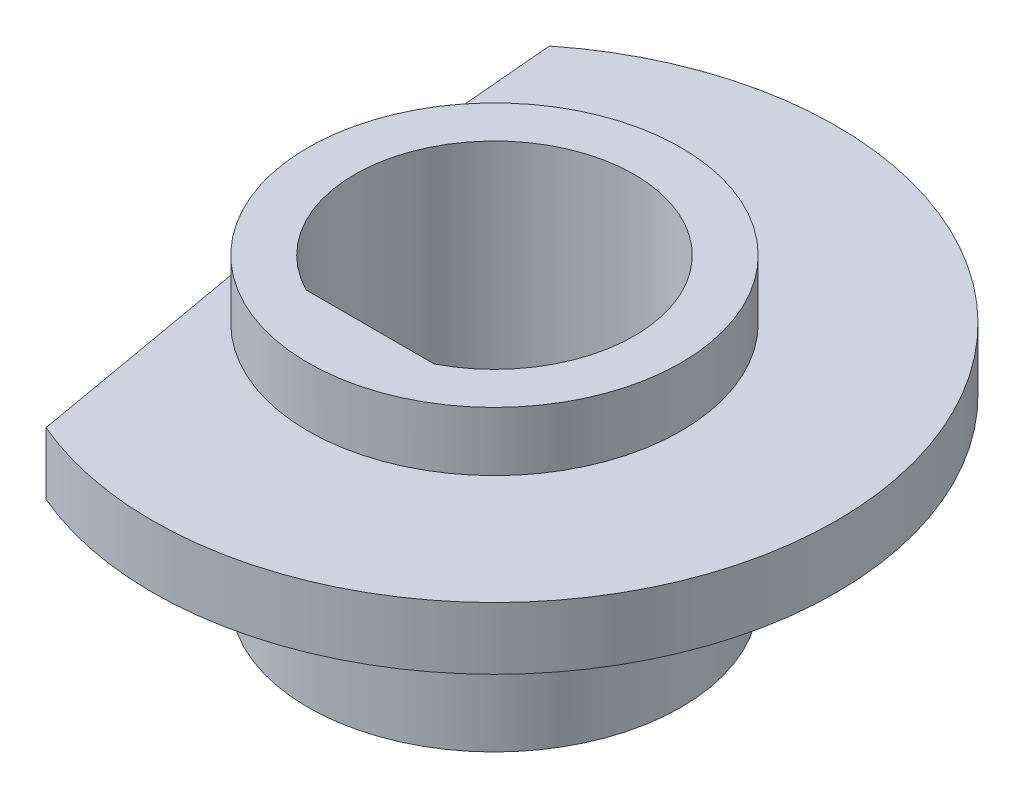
ISO-10303-21;
HEADER;
FILE_DESCRIPTION(('STEP AP214'),'2;1');
FILE_NAME('part.step','',(''),(''),'','','');
FILE_SCHEMA(('AUTOMOTIVE_DESIGN { 1 0 10303 214 1 1 1 1 }'));
ENDSEC;
DATA;
#1=APPLICATION_CONTEXT('core data for automotive mechanical design processes');
#2=APPLICATION_PROTOCOL_DEFINITION('international standard','automotive_design',2000,#1);
#3=PRODUCT_CONTEXT('',#1,'mechanical');
#4=PRODUCT('Part','Part','',(#3));
#5=PRODUCT_RELATED_PRODUCT_CATEGORY('part','',(#4));
#6=PRODUCT_DEFINITION_FORMATION('','',#4);
#7=PRODUCT_DEFINITION_CONTEXT('part definition',#1,'design');
#8=PRODUCT_DEFINITION('design','',#6,#7);
#9=PRODUCT_DEFINITION_SHAPE('','',#8);
#10=(LENGTH_UNIT() NAMED_UNIT(*) SI_UNIT(.MILLI.,.METRE.));
#11=(NAMED_UNIT(*) PLANE_ANGLE_UNIT() SI_UNIT($,.RADIAN.));
#12=(NAMED_UNIT(*) SI_UNIT($,.STERADIAN.) SOLID_ANGLE_UNIT());
#13=UNCERTAINTY_MEASURE_WITH_UNIT(LENGTH_MEASURE(1.E-05),#10,'distance_accuracy_value','');
#14=(GEOMETRIC_REPRESENTATION_CONTEXT(3) GLOBAL_UNCERTAINTY_ASSIGNED_CONTEXT((#13)) GLOBAL_UNIT_ASSIGNED_CONTEXT((#10,
#11,#12)) REPRESENTATION_CONTEXT('',''));
#15=CARTESIAN_POINT('',(0.,0.,0.));
#16=DIRECTION('',(0.,0.,1.));
#17=DIRECTION('',(1.,0.,0.));
#18=AXIS2_PLACEMENT_3D('',#15,#16,#17);
#19=CARTESIAN_POINT('',(-6.84584853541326,-9.28929420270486,-8.61013111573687));
#20=DIRECTION('',(0.996194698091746,0.,-0.087155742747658));
#21=DIRECTION('',(-0.087155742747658,0.,-0.996194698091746));
#22=AXIS2_PLACEMENT_3D('',#19,#20,#21);
#23=PLANE('',#22);
#24=DIRECTION('',(0.,-1.,0.));
#25=VECTOR('',#24,1.);
#26=CARTESIAN_POINT('',(-6.84584853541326,-8.28929420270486,-8.61013111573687));
#27=LINE('',#26,#25);
#28=CARTESIAN_POINT('',(-6.84584853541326,-9.28929420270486,-8.61013111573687));
#29=VERTEX_POINT('',#28);
#30=CARTESIAN_POINT('',(-6.84584853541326,-7.28929420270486,-8.61013111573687));
#31=VERTEX_POINT('',#30);
#32=EDGE_CURVE('E126',#29,#31,#27,.F.);
#33=ORIENTED_EDGE('',*,*,#32,.F.);
#34=DIRECTION('',(-0.087155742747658,0.,-0.996194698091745));
#35=VECTOR('',#34,1.);
#36=CARTESIAN_POINT('',(-6.09255967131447,-9.28929420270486,0.));
#37=LINE('',#36,#35);
#38=CARTESIAN_POINT('',(-6.09255967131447,-9.28929420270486,0.));
#39=VERTEX_POINT('',#38);
#40=EDGE_CURVE('E110',#39,#29,#37,.T.);
#41=ORIENTED_EDGE('',*,*,#40,.F.);
#42=DIRECTION('',(0.,1.,0.));
#43=VECTOR('',#42,1.);
#44=CARTESIAN_POINT('',(-6.09255967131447,-9.28929420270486,0.));
#45=LINE('',#44,#43);
#46=CARTESIAN_POINT('',(-6.09255967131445,-7.28929420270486,1.6502415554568E-13));
#47=VERTEX_POINT('',#46);
#48=EDGE_CURVE('E128',#39,#47,#45,.T.);
#49=ORIENTED_EDGE('',*,*,#48,.T.);
#50=DIRECTION('',(0.087155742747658,0.,0.996194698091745));
#51=VECTOR('',#50,1.);
#52=CARTESIAN_POINT('',(-6.84584853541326,-7.28929420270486,-8.61013111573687));
#53=LINE('',#52,#51);
#54=EDGE_CURVE('E59',#31,#47,#53,.T.);
#55=ORIENTED_EDGE('',*,*,#54,.F.);
#56=EDGE_LOOP('',(#33,#41,#49,#55));
#57=FACE_BOUND('',#56,.T.);
#58=ADVANCED_FACE('F15',(#57),#23,.F.);
#59=CARTESIAN_POINT('',(0.,-8.28929420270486,0.));
#60=DIRECTION('',(0.,-1.,0.));
#61=DIRECTION('',(1.,0.,0.));
#62=AXIS2_PLACEMENT_3D('',#59,#60,#61);
#63=CYLINDRICAL_SURFACE('',#62,11.);
#64=DIRECTION('',(0.,1.,0.));
#65=VECTOR('',#64,1.);
#66=CARTESIAN_POINT('',(-4.30788942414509,-9.28929420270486,10.1213679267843));
#67=LINE('',#66,#65);
#68=CARTESIAN_POINT('',(-4.30788942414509,-7.28929420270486,10.1213679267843));
#69=VERTEX_POINT('',#68);
#70=CARTESIAN_POINT('',(-4.30788942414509,-9.28929420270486,10.1213679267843));
#71=VERTEX_POINT('',#70);
#72=EDGE_CURVE('E54',#69,#71,#67,.F.);
#73=ORIENTED_EDGE('',*,*,#72,.T.);
#74=CARTESIAN_POINT('',(0.,-9.28929420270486,0.));
#75=DIRECTION('',(0.,-1.,0.));
#76=DIRECTION('',(1.,0.,0.));
#77=AXIS2_PLACEMENT_3D('',#74,#75,#76);
#78=CIRCLE('',#77,11.);
#79=EDGE_CURVE('E109',#29,#71,#78,.T.);
#80=ORIENTED_EDGE('',*,*,#79,.F.);
#81=ORIENTED_EDGE('',*,*,#32,.T.);
#82=CARTESIAN_POINT('',(0.,-7.28929420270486,0.));
#83=DIRECTION('',(0.,-1.,0.));
#84=DIRECTION('',(1.,0.,0.));
#85=AXIS2_PLACEMENT_3D('',#82,#83,#84);
#86=CIRCLE('',#85,11.);
#87=EDGE_CURVE('E19',#69,#31,#86,.F.);
#88=ORIENTED_EDGE('',*,*,#87,.F.);
#89=EDGE_LOOP('',(#73,#80,#81,#88));
#90=FACE_BOUND('',#89,.T.);
#91=ADVANCED_FACE('F143',(#90),#63,.T.);
#92=CARTESIAN_POINT('',(-6.09255967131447,-9.28929420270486,0.));
#93=DIRECTION('',(0.984807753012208,0.,-0.17364817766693));
#94=DIRECTION('',(-0.17364817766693,0.,-0.984807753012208));
#95=AXIS2_PLACEMENT_3D('',#92,#93,#94);
#96=PLANE('',#95);
#97=ORIENTED_EDGE('',*,*,#48,.F.);
#98=DIRECTION('',(-0.17364817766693,0.,-0.984807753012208));
#99=VECTOR('',#98,1.);
#100=CARTESIAN_POINT('',(-6.09255967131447,-9.28929420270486,0.));
#101=LINE('',#100,#99);
#102=CARTESIAN_POINT('',(-5.90884651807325,-9.28929420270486,1.04188906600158));
#103=VERTEX_POINT('',#102);
#104=EDGE_CURVE('E125',#103,#39,#101,.T.);
#105=ORIENTED_EDGE('',*,*,#104,.F.);
#106=DIRECTION('',(-0.17364817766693,0.,-0.984807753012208));
#107=VECTOR('',#106,1.);
#108=CARTESIAN_POINT('',(-4.3078894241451,-9.28929420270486,10.1213679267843));
#109=LINE('',#108,#107);
#110=EDGE_CURVE('E108',#71,#103,#109,.T.);
#111=ORIENTED_EDGE('',*,*,#110,.F.);
#112=ORIENTED_EDGE('',*,*,#72,.F.);
#113=DIRECTION('',(0.17364817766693,0.,0.984807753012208));
#114=VECTOR('',#113,1.);
#115=CARTESIAN_POINT('',(-5.90884651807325,-7.28929420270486,1.04188906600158));
#116=LINE('',#115,#114);
#117=CARTESIAN_POINT('',(-5.90884651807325,-7.28929420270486,1.04188906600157));
#118=VERTEX_POINT('',#117);
#119=EDGE_CURVE('E119',#118,#69,#116,.T.);
#120=ORIENTED_EDGE('',*,*,#119,.F.);
#121=DIRECTION('',(0.173648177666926,0.,0.984807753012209));
#122=VECTOR('',#121,1.);
#123=CARTESIAN_POINT('',(-6.09255967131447,-7.28929420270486,0.));
#124=LINE('',#123,#122);
#125=EDGE_CURVE('E34',#47,#118,#124,.T.);
#126=ORIENTED_EDGE('',*,*,#125,.F.);
#127=EDGE_LOOP('',(#97,#105,#111,#112,#120,#126));
#128=FACE_BOUND('',#127,.T.);
#129=ADVANCED_FACE('F146',(#128),#96,.F.);
#130=CARTESIAN_POINT('',(8.5,-7.28929420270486,0.));
#131=DIRECTION('',(0.,1.,0.));
#132=DIRECTION('',(0.,0.,1.));
#133=AXIS2_PLACEMENT_3D('',#130,#131,#132);
#134=PLANE('',#133);
#135=ORIENTED_EDGE('',*,*,#119,.T.);
#136=ORIENTED_EDGE('',*,*,#87,.T.);
#137=ORIENTED_EDGE('',*,*,#54,.T.);
#138=ORIENTED_EDGE('',*,*,#125,.T.);
#139=CARTESIAN_POINT('',(0.,-7.28929420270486,0.));
#140=DIRECTION('',(0.,-1.,0.));
#141=DIRECTION('',(1.,0.,0.));
#142=AXIS2_PLACEMENT_3D('',#139,#140,#141);
#143=CIRCLE('',#142,6.);
#144=EDGE_CURVE('E107',#118,#118,#143,.F.);
#145=ORIENTED_EDGE('',*,*,#144,.F.);
#146=EDGE_LOOP('',(#135,#136,#137,#138,#145));
#147=FACE_BOUND('',#146,.T.);
#148=ADVANCED_FACE('F141',(#147),#134,.T.);
#149=CARTESIAN_POINT('',(8.5,-9.28929420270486,0.));
#150=DIRECTION('',(0.,-1.,0.));
#151=DIRECTION('',(0.,0.,-1.));
#152=AXIS2_PLACEMENT_3D('',#149,#150,#151);
#153=PLANE('',#152);
#154=CARTESIAN_POINT('',(0.,-9.28929420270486,0.));
#155=DIRECTION('',(0.,-1.,0.));
#156=DIRECTION('',(1.,0.,0.));
#157=AXIS2_PLACEMENT_3D('',#154,#155,#156);
#158=CIRCLE('',#157,6.);
#159=EDGE_CURVE('E104',#103,#103,#158,.T.);
#160=ORIENTED_EDGE('',*,*,#159,.F.);
#161=ORIENTED_EDGE('',*,*,#104,.T.);
#162=ORIENTED_EDGE('',*,*,#40,.T.);
#163=ORIENTED_EDGE('',*,*,#79,.T.);
#164=ORIENTED_EDGE('',*,*,#110,.T.);
#165=EDGE_LOOP('',(#160,#161,#162,#163,#164));
#166=FACE_BOUND('',#165,.T.);
#167=ADVANCED_FACE('F145',(#166),#153,.T.);
#168=CARTESIAN_POINT('',(0.,-6.33929420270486,0.));
#169=DIRECTION('',(0.,-1.,0.));
#170=DIRECTION('',(1.,0.,0.));
#171=AXIS2_PLACEMENT_3D('',#168,#169,#170);
#172=CYLINDRICAL_SURFACE('',#171,6.);
#173=CARTESIAN_POINT('',(0.,-5.38929420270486,0.));
#174=DIRECTION('',(0.,-1.,0.));
#175=DIRECTION('',(1.,0.,0.));
#176=AXIS2_PLACEMENT_3D('',#173,#174,#175);
#177=CIRCLE('',#176,6.);
#178=CARTESIAN_POINT('',(6.,-5.38929420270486,0.));
#179=VERTEX_POINT('',#178);
#180=EDGE_CURVE('E101',#179,#179,#177,.F.);
#181=ORIENTED_EDGE('',*,*,#180,.F.);
#182=EDGE_LOOP('',(#181));
#183=FACE_BOUND('',#182,.T.);
#184=ORIENTED_EDGE('',*,*,#144,.T.);
#185=EDGE_LOOP('',(#184));
#186=FACE_BOUND('',#185,.T.);
#187=ADVANCED_FACE('F151',(#183,#186),#172,.T.);
#188=CARTESIAN_POINT('',(0.,-12.1392942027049,0.));
#189=DIRECTION('',(0.,-1.,0.));
#190=DIRECTION('',(1.,0.,0.));
#191=AXIS2_PLACEMENT_3D('',#188,#189,#190);
#192=CYLINDRICAL_SURFACE('',#191,6.);
#193=ORIENTED_EDGE('',*,*,#159,.T.);
#194=EDGE_LOOP('',(#193));
#195=FACE_BOUND('',#194,.T.);
#196=CARTESIAN_POINT('',(0.,-14.9892942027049,0.));
#197=DIRECTION('',(0.,-1.,0.));
#198=DIRECTION('',(1.,0.,0.));
#199=AXIS2_PLACEMENT_3D('',#196,#197,#198);
#200=CIRCLE('',#199,6.);
#201=CARTESIAN_POINT('',(6.,-14.9892942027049,0.));
#202=VERTEX_POINT('',#201);
#203=EDGE_CURVE('E85',#202,#202,#200,.T.);
#204=ORIENTED_EDGE('',*,*,#203,.F.);
#205=EDGE_LOOP('',(#204));
#206=FACE_BOUND('',#205,.T.);
#207=ADVANCED_FACE('F148',(#195,#206),#192,.T.);
#208=CARTESIAN_POINT('',(5.25,-5.38929420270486,0.));
#209=DIRECTION('',(0.,1.,0.));
#210=DIRECTION('',(0.,0.,1.));
#211=AXIS2_PLACEMENT_3D('',#208,#209,#210);
#212=PLANE('',#211);
#213=CARTESIAN_POINT('',(0.,-5.38929420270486,0.));
#214=DIRECTION('',(0.,-1.,0.));
#215=DIRECTION('',(1.,0.,0.));
#216=AXIS2_PLACEMENT_3D('',#213,#214,#215);
#217=CIRCLE('',#216,4.5);
#218=CARTESIAN_POINT('',(-2.06155281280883,-5.38929420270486,4.));
#219=VERTEX_POINT('',#218);
#220=CARTESIAN_POINT('',(2.06155281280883,-5.38929420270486,4.));
#221=VERTEX_POINT('',#220);
#222=EDGE_CURVE('E89',#219,#221,#217,.T.);
#223=ORIENTED_EDGE('',*,*,#222,.T.);
#224=DIRECTION('',(-1.,0.,0.));
#225=VECTOR('',#224,1.);
#226=CARTESIAN_POINT('',(-2.06155281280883,-5.38929420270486,4.));
#227=LINE('',#226,#225);
#228=EDGE_CURVE('E77',#219,#221,#227,.F.);
#229=ORIENTED_EDGE('',*,*,#228,.F.);
#230=EDGE_LOOP('',(#223,#229));
#231=FACE_BOUND('',#230,.T.);
#232=ORIENTED_EDGE('',*,*,#180,.T.);
#233=EDGE_LOOP('',(#232));
#234=FACE_BOUND('',#233,.T.);
#235=ADVANCED_FACE('F92',(#231,#234),#212,.T.);
#236=CARTESIAN_POINT('',(5.25,-14.9892942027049,0.));
#237=DIRECTION('',(0.,-1.,0.));
#238=DIRECTION('',(0.,0.,-1.));
#239=AXIS2_PLACEMENT_3D('',#236,#237,#238);
#240=PLANE('',#239);
#241=CARTESIAN_POINT('',(0.,-14.9892942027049,0.));
#242=DIRECTION('',(0.,-1.,0.));
#243=DIRECTION('',(1.,0.,0.));
#244=AXIS2_PLACEMENT_3D('',#241,#242,#243);
#245=CIRCLE('',#244,4.5);
#246=CARTESIAN_POINT('',(2.06155281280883,-14.9892942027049,4.));
#247=VERTEX_POINT('',#246);
#248=CARTESIAN_POINT('',(-2.06155281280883,-14.9892942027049,4.));
#249=VERTEX_POINT('',#248);
#250=EDGE_CURVE('E25',#247,#249,#245,.F.);
#251=ORIENTED_EDGE('',*,*,#250,.T.);
#252=DIRECTION('',(-1.,0.,0.));
#253=VECTOR('',#252,1.);
#254=CARTESIAN_POINT('',(-2.06155281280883,-14.9892942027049,4.));
#255=LINE('',#254,#253);
#256=EDGE_CURVE('E84',#247,#249,#255,.T.);
#257=ORIENTED_EDGE('',*,*,#256,.F.);
#258=EDGE_LOOP('',(#251,#257));
#259=FACE_BOUND('',#258,.T.);
#260=ORIENTED_EDGE('',*,*,#203,.T.);
#261=EDGE_LOOP('',(#260));
#262=FACE_BOUND('',#261,.T.);
#263=ADVANCED_FACE('F155',(#259,#262),#240,.T.);
#264=CARTESIAN_POINT('',(-2.06155281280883,-14.9892942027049,4.));
#265=DIRECTION('',(0.,0.,-1.));
#266=DIRECTION('',(-1.,0.,0.));
#267=AXIS2_PLACEMENT_3D('',#264,#265,#266);
#268=PLANE('',#267);
#269=ORIENTED_EDGE('',*,*,#256,.T.);
#270=DIRECTION('',(0.,-1.,0.));
#271=VECTOR('',#270,1.);
#272=CARTESIAN_POINT('',(-2.06155281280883,-10.1892942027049,4.));
#273=LINE('',#272,#271);
#274=EDGE_CURVE('E10',#249,#219,#273,.F.);
#275=ORIENTED_EDGE('',*,*,#274,.T.);
#276=ORIENTED_EDGE('',*,*,#228,.T.);
#277=DIRECTION('',(0.,-1.,0.));
#278=VECTOR('',#277,1.);
#279=CARTESIAN_POINT('',(2.06155281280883,-10.1892942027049,4.));
#280=LINE('',#279,#278);
#281=EDGE_CURVE('E80',#221,#247,#280,.T.);
#282=ORIENTED_EDGE('',*,*,#281,.T.);
#283=EDGE_LOOP('',(#269,#275,#276,#282));
#284=FACE_BOUND('',#283,.T.);
#285=ADVANCED_FACE('F79',(#284),#268,.T.);
#286=CARTESIAN_POINT('',(0.,-10.1892942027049,0.));
#287=DIRECTION('',(0.,-1.,0.));
#288=DIRECTION('',(1.,0.,0.));
#289=AXIS2_PLACEMENT_3D('',#286,#287,#288);
#290=CYLINDRICAL_SURFACE('',#289,4.5);
#291=ORIENTED_EDGE('',*,*,#250,.F.);
#292=ORIENTED_EDGE('',*,*,#281,.F.);
#293=ORIENTED_EDGE('',*,*,#222,.F.);
#294=ORIENTED_EDGE('',*,*,#274,.F.);
#295=EDGE_LOOP('',(#291,#292,#293,#294));
#296=FACE_BOUND('',#295,.T.);
#297=ADVANCED_FACE('F17',(#296),#290,.F.);
#298=CLOSED_SHELL('',(#58,#91,#129,#148,#167,#187,#207,#235,#263,#285,#297));
#299=MANIFOLD_SOLID_BREP('B1',#298);
#300=ADVANCED_BREP_SHAPE_REPRESENTATION('',(#18,#299),#14);
#301=SHAPE_DEFINITION_REPRESENTATION(#9,#300);
ENDSEC;
END-ISO-10303-21;
